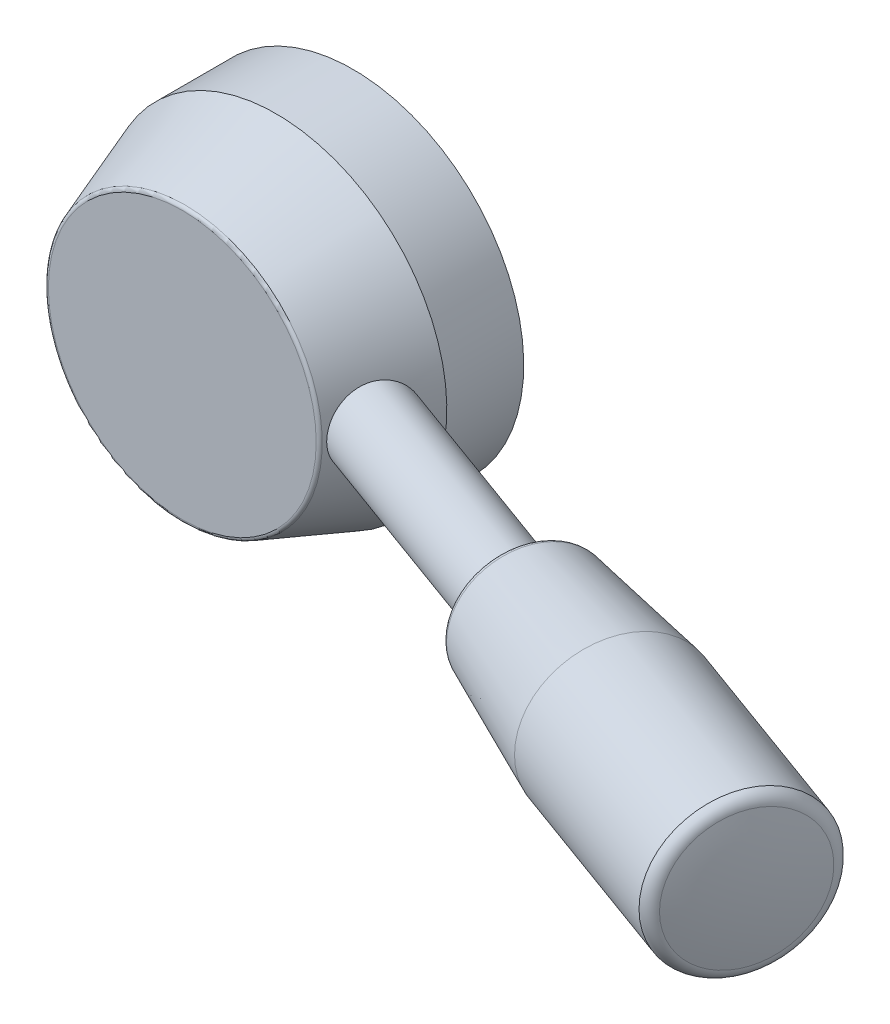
ISO-10303-21;
HEADER;
FILE_DESCRIPTION(('STEP AP214'),'2;1');
FILE_NAME('part.step','',(''),(''),'','','');
FILE_SCHEMA(('AUTOMOTIVE_DESIGN { 1 0 10303 214 1 1 1 1 }'));
ENDSEC;
DATA;
#1=APPLICATION_CONTEXT('core data for automotive mechanical design processes');
#2=APPLICATION_PROTOCOL_DEFINITION('international standard','automotive_design',2000,#1);
#3=PRODUCT_CONTEXT('',#1,'mechanical');
#4=PRODUCT('Part','Part','',(#3));
#5=PRODUCT_RELATED_PRODUCT_CATEGORY('part','',(#4));
#6=PRODUCT_DEFINITION_FORMATION('','',#4);
#7=PRODUCT_DEFINITION_CONTEXT('part definition',#1,'design');
#8=PRODUCT_DEFINITION('design','',#6,#7);
#9=PRODUCT_DEFINITION_SHAPE('','',#8);
#10=(LENGTH_UNIT() NAMED_UNIT(*) SI_UNIT(.MILLI.,.METRE.));
#11=(NAMED_UNIT(*) PLANE_ANGLE_UNIT() SI_UNIT($,.RADIAN.));
#12=(NAMED_UNIT(*) SI_UNIT($,.STERADIAN.) SOLID_ANGLE_UNIT());
#13=UNCERTAINTY_MEASURE_WITH_UNIT(LENGTH_MEASURE(1.E-05),#10,'distance_accuracy_value','');
#14=(GEOMETRIC_REPRESENTATION_CONTEXT(3) GLOBAL_UNCERTAINTY_ASSIGNED_CONTEXT((#13)) GLOBAL_UNIT_ASSIGNED_CONTEXT((#10,
#11,#12)) REPRESENTATION_CONTEXT('',''));
#15=CARTESIAN_POINT('',(0.,0.,0.));
#16=DIRECTION('',(0.,0.,1.));
#17=DIRECTION('',(1.,0.,0.));
#18=AXIS2_PLACEMENT_3D('',#15,#16,#17);
#19=CARTESIAN_POINT('',(0.,0.,21.8420201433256));
#20=DIRECTION('',(0.,0.,-1.));
#21=DIRECTION('',(0.,1.,0.));
#22=AXIS2_PLACEMENT_3D('',#19,#20,#21);
#23=CONICAL_SURFACE('',#22,18.2394850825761,0.349065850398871);
#24=CARTESIAN_POINT('',(0.,0.,22.171010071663));
#25=DIRECTION('',(0.,0.,1.));
#26=DIRECTION('',(0.,-1.,0.));
#27=AXIS2_PLACEMENT_3D('',#24,#25,#26);
#28=CIRCLE('',#27,18.1197425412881);
#29=CARTESIAN_POINT('',(0.,-18.1197425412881,22.171010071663));
#30=VERTEX_POINT('',#29);
#31=EDGE_CURVE('E8',#30,#30,#28,.F.);
#32=ORIENTED_EDGE('',*,*,#31,.T.);
#33=EDGE_LOOP('',(#32));
#34=FACE_BOUND('',#33,.T.);
#35=CARTESIAN_POINT('',(0.,0.,10.1363516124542));
#36=DIRECTION('',(0.,0.,1.));
#37=DIRECTION('',(0.,-1.,0.));
#38=AXIS2_PLACEMENT_3D('',#35,#36,#37);
#39=CIRCLE('',#38,22.5);
#40=CARTESIAN_POINT('',(0.,-22.5,10.1363516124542));
#41=VERTEX_POINT('',#40);
#42=EDGE_CURVE('E65',#41,#41,#39,.T.);
#43=ORIENTED_EDGE('',*,*,#42,.T.);
#44=EDGE_LOOP('',(#43));
#45=FACE_BOUND('',#44,.T.);
#46=CARTESIAN_POINT('',(21.03522681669,3.31735900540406,13.4465062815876));
#47=CARTESIAN_POINT('',(20.9413908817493,3.52790948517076,13.6110525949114));
#48=CARTESIAN_POINT('',(20.8404686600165,3.72265857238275,13.7919616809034));
#49=CARTESIAN_POINT('',(20.6295642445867,4.07519953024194,14.1824608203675));
#50=CARTESIAN_POINT('',(20.5195758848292,4.23296596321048,14.3920704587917));
#51=CARTESIAN_POINT('',(20.2959229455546,4.50704192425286,14.8352671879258));
#52=CARTESIAN_POINT('',(20.182256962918,4.62333542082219,15.0688635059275));
#53=CARTESIAN_POINT('',(19.9567147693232,4.81078269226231,15.5542752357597));
#54=CARTESIAN_POINT('',(19.8448380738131,4.88194889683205,15.8060856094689));
#55=CARTESIAN_POINT('',(19.6293852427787,4.97613745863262,16.3176963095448));
#56=CARTESIAN_POINT('',(19.5257145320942,4.99982251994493,16.5773345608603));
#57=CARTESIAN_POINT('',(19.3289618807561,5.00017543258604,17.1006124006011));
#58=CARTESIAN_POINT('',(19.2358787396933,4.97684861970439,17.3642515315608));
#59=CARTESIAN_POINT('',(19.0648236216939,4.88489105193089,17.8823700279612));
#60=CARTESIAN_POINT('',(18.9865830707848,4.81719029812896,18.1369266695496));
#61=CARTESIAN_POINT('',(18.8441366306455,4.63954525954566,18.6349711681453));
#62=CARTESIAN_POINT('',(18.7799316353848,4.52959828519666,18.8784583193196));
#63=CARTESIAN_POINT('',(18.6649406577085,4.26951338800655,19.3494883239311));
#64=CARTESIAN_POINT('',(18.6142863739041,4.11900768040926,19.5768599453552));
#65=CARTESIAN_POINT('',(18.5260220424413,3.78245485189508,20.0064591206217));
#66=CARTESIAN_POINT('',(18.488414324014,3.59640139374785,20.2086821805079));
#67=CARTESIAN_POINT('',(18.4235557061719,3.1882360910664,20.5868019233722));
#68=CARTESIAN_POINT('',(18.3966033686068,2.96530425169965,20.7618658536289));
#69=CARTESIAN_POINT('',(18.3522107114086,2.49293168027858,21.0731669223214));
#70=CARTESIAN_POINT('',(18.334770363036,2.24349102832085,21.2094041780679));
#71=CARTESIAN_POINT('',(18.3072451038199,1.72482906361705,21.4380050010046));
#72=CARTESIAN_POINT('',(18.2971602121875,1.45560769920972,21.530368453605));
#73=CARTESIAN_POINT('',(18.2826971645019,0.90515534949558,21.6674050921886));
#74=CARTESIAN_POINT('',(18.2783177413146,0.62392704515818,21.712088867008));
#75=CARTESIAN_POINT('',(18.2744636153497,0.0659502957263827,21.7512741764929));
#76=CARTESIAN_POINT('',(18.2748541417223,-0.210700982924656,21.7471547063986));
#77=CARTESIAN_POINT('',(18.2802929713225,-0.759266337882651,21.6922408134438));
#78=CARTESIAN_POINT('',(18.2853410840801,-1.03118060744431,21.6414482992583));
#79=CARTESIAN_POINT('',(18.3009309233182,-1.55999081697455,21.495994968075));
#80=CARTESIAN_POINT('',(18.3114195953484,-1.8170056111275,21.4017587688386));
#81=CARTESIAN_POINT('',(18.3394015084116,-2.31207637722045,21.1731007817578));
#82=CARTESIAN_POINT('',(18.3568958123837,-2.55012946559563,21.0386728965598));
#83=CARTESIAN_POINT('',(18.4013800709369,-3.00691505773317,20.7304200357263));
#84=CARTESIAN_POINT('',(18.4285946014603,-3.22502256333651,20.5557012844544));
#85=CARTESIAN_POINT('',(18.4946163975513,-3.62948438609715,20.1745410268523));
#86=CARTESIAN_POINT('',(18.5334251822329,-3.81583453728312,19.9680953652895));
#87=CARTESIAN_POINT('',(18.625401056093,-4.15501876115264,19.5256402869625));
#88=CARTESIAN_POINT('',(18.6788269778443,-4.30714864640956,19.2891436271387));
#89=CARTESIAN_POINT('',(18.8008876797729,-4.56871240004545,18.7972165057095));
#90=CARTESIAN_POINT('',(18.8695203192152,-4.67815227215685,18.5417887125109));
#91=CARTESIAN_POINT('',(19.0206381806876,-4.84934477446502,18.0244256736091));
#92=CARTESIAN_POINT('',(19.1028709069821,-4.91186875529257,17.7626722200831));
#93=CARTESIAN_POINT('',(19.2804098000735,-4.99014072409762,17.236633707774));
#94=CARTESIAN_POINT('',(19.3757141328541,-5.00589526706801,16.9723490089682));
#95=CARTESIAN_POINT('',(19.5740823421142,-4.99034218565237,16.455055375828));
#96=CARTESIAN_POINT('',(19.6769200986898,-4.96009808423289,16.2019267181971));
#97=CARTESIAN_POINT('',(19.8882921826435,-4.85554098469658,15.7074363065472));
#98=CARTESIAN_POINT('',(19.9968268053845,-4.78122569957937,15.4660751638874));
#99=CARTESIAN_POINT('',(20.21584121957,-4.59009301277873,14.999230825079));
#100=CARTESIAN_POINT('',(20.3263295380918,-4.47295507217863,14.7738831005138));
#101=CARTESIAN_POINT('',(20.543461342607,-4.19961575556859,14.3461941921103));
#102=CARTESIAN_POINT('',(20.6501042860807,-4.04340889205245,14.1438562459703));
#103=CARTESIAN_POINT('',(20.8570348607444,-3.69189082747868,13.7619847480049));
#104=CARTESIAN_POINT('',(20.9571078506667,-3.4957292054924,13.5831169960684));
#105=CARTESIAN_POINT('',(21.1429464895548,-3.07203776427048,13.2580549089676));
#106=CARTESIAN_POINT('',(21.2287114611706,-2.84450646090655,13.1118621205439));
#107=CARTESIAN_POINT('',(21.3818518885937,-2.36278265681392,12.8548052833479));
#108=CARTESIAN_POINT('',(21.4491183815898,-2.10844389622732,12.7441499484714));
#109=CARTESIAN_POINT('',(21.5608237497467,-1.5813611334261,12.5621368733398));
#110=CARTESIAN_POINT('',(21.6052658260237,-1.30861971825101,12.4907736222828));
#111=CARTESIAN_POINT('',(21.6681695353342,-0.757693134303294,12.3901626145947));
#112=CARTESIAN_POINT('',(21.6870826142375,-0.479693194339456,12.3601828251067));
#113=CARTESIAN_POINT('',(21.6993055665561,0.0782998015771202,12.3407811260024));
#114=CARTESIAN_POINT('',(21.6926150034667,0.358292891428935,12.3513599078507));
#115=CARTESIAN_POINT('',(21.6543103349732,0.907970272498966,12.4123247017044));
#116=CARTESIAN_POINT('',(21.6230615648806,1.17774539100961,12.4621272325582));
#117=CARTESIAN_POINT('',(21.5378371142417,1.70361627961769,12.599512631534));
#118=CARTESIAN_POINT('',(21.4838734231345,1.95971918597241,12.6870755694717));
#119=CARTESIAN_POINT('',(21.3677664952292,2.40675255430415,12.8786203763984));
#120=CARTESIAN_POINT('',(21.3088822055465,2.60107853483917,12.9767434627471));
#121=CARTESIAN_POINT('',(21.1798998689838,2.97271669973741,13.1953007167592));
#122=CARTESIAN_POINT('',(21.1098011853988,3.15002791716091,13.3157361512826));
#123=CARTESIAN_POINT('',(21.03522681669,3.31735900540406,13.4465062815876));
#124=B_SPLINE_CURVE_WITH_KNOTS('',3,(#46,#47,#48,#49,#50,#51,#52,#53,#54,#55,#56,#57,#58,#59,
#60,#61,#62,#63,#64,#65,#66,#67,#68,#69,#70,#71,#72,#73,#74,#75,#76,#77,#78,#79,#80,#81,#82,#83,
#84,#85,#86,#87,#88,#89,#90,#91,#92,#93,#94,#95,#96,#97,#98,#99,#100,#101,#102,#103,#104,#105,
#106,#107,#108,#109,#110,#111,#112,#113,#114,#115,#116,#117,#118,#119,#120,#121,#122,#123),
.UNSPECIFIED.,.T.,.F.,(4,2,2,2,2,2,2,2,2,2,2,2,2,2,2,2,2,2,2,2,2,2,2,2,2,2,2,2,2,2,2,2,2,2,2,2,
2,2,4),(0.,0.848850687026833,1.69828353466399,2.54804437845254,3.39757106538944,
4.23515580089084,5.07264547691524,5.89312110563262,6.71364897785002,7.54188345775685,
8.3702657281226,9.22044550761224,10.0706227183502,10.9208021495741,11.7707927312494,
12.5968244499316,13.4228223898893,14.2409128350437,15.0591274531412,15.8976189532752,
16.7362203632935,17.5907574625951,18.4451743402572,19.2852157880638,20.1251394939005,
20.9459365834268,21.7667762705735,22.5938903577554,23.4211206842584,24.268254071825,
25.115427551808,25.9674892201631,26.8194313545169,27.6561015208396,28.4927859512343,
29.3172539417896,30.1412873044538,30.8158573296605,31.4904656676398),.UNSPECIFIED.);
#125=CARTESIAN_POINT('',(21.03522681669,3.31735900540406,13.4465062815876));
#126=VERTEX_POINT('',#125);
#127=EDGE_CURVE('E23',#126,#126,#124,.T.);
#128=ORIENTED_EDGE('',*,*,#127,.F.);
#129=EDGE_LOOP('',(#128));
#130=FACE_BOUND('',#129,.T.);
#131=ADVANCED_FACE('F12',(#34,#45,#130),#23,.T.);
#132=CARTESIAN_POINT('',(-5.,0.,14.));
#133=DIRECTION('',(0.,0.,-1.));
#134=DIRECTION('',(0.,1.,0.));
#135=AXIS2_PLACEMENT_3D('',#132,#133,#134);
#136=PLANE('',#135);
#137=CARTESIAN_POINT('',(0.,0.,14.));
#138=DIRECTION('',(0.,0.,1.));
#139=DIRECTION('',(0.,-1.,0.));
#140=AXIS2_PLACEMENT_3D('',#137,#138,#139);
#141=CIRCLE('',#140,5.);
#142=CARTESIAN_POINT('',(0.,-5.,14.));
#143=VERTEX_POINT('',#142);
#144=EDGE_CURVE('E27',#143,#143,#141,.T.);
#145=ORIENTED_EDGE('',*,*,#144,.F.);
#146=EDGE_LOOP('',(#145));
#147=FACE_BOUND('',#146,.T.);
#148=ADVANCED_FACE('F14',(#147),#136,.T.);
#149=CARTESIAN_POINT('',(0.,0.,27.5));
#150=DIRECTION('',(0.,0.,1.));
#151=DIRECTION('',(0.,-1.,0.));
#152=AXIS2_PLACEMENT_3D('',#149,#150,#151);
#153=CYLINDRICAL_SURFACE('',#152,5.);
#154=CARTESIAN_POINT('',(0.,0.,0.));
#155=DIRECTION('',(0.,0.,1.));
#156=DIRECTION('',(0.,-1.,0.));
#157=AXIS2_PLACEMENT_3D('',#154,#155,#156);
#158=CIRCLE('',#157,5.);
#159=CARTESIAN_POINT('',(0.,-5.,0.));
#160=VERTEX_POINT('',#159);
#161=EDGE_CURVE('E73',#160,#160,#158,.T.);
#162=ORIENTED_EDGE('',*,*,#161,.F.);
#163=EDGE_LOOP('',(#162));
#164=FACE_BOUND('',#163,.T.);
#165=ORIENTED_EDGE('',*,*,#144,.T.);
#166=EDGE_LOOP('',(#165));
#167=FACE_BOUND('',#166,.T.);
#168=ADVANCED_FACE('F59',(#164,#167),#153,.F.);
#169=CARTESIAN_POINT('',(-22.5,0.,0.));
#170=DIRECTION('',(0.,0.,-1.));
#171=DIRECTION('',(0.,1.,0.));
#172=AXIS2_PLACEMENT_3D('',#169,#170,#171);
#173=PLANE('',#172);
#174=ORIENTED_EDGE('',*,*,#161,.T.);
#175=EDGE_LOOP('',(#174));
#176=FACE_BOUND('',#175,.T.);
#177=CARTESIAN_POINT('',(0.,0.,0.));
#178=DIRECTION('',(0.,0.,1.));
#179=DIRECTION('',(0.,-1.,0.));
#180=AXIS2_PLACEMENT_3D('',#177,#178,#179);
#181=CIRCLE('',#180,22.5);
#182=CARTESIAN_POINT('',(0.,-22.5,0.));
#183=VERTEX_POINT('',#182);
#184=EDGE_CURVE('E69',#183,#183,#181,.T.);
#185=ORIENTED_EDGE('',*,*,#184,.F.);
#186=EDGE_LOOP('',(#185));
#187=FACE_BOUND('',#186,.T.);
#188=ADVANCED_FACE('F53',(#176,#187),#173,.T.);
#189=CARTESIAN_POINT('',(0.,0.,27.5));
#190=DIRECTION('',(0.,0.,1.));
#191=DIRECTION('',(0.,-1.,0.));
#192=AXIS2_PLACEMENT_3D('',#189,#190,#191);
#193=CYLINDRICAL_SURFACE('',#192,22.5);
#194=ORIENTED_EDGE('',*,*,#184,.T.);
#195=EDGE_LOOP('',(#194));
#196=FACE_BOUND('',#195,.T.);
#197=ORIENTED_EDGE('',*,*,#42,.F.);
#198=EDGE_LOOP('',(#197));
#199=FACE_BOUND('',#198,.T.);
#200=ADVANCED_FACE('F48',(#196,#199),#193,.T.);
#201=CARTESIAN_POINT('',(-17.2997924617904,0.,22.5));
#202=DIRECTION('',(0.,0.,-1.));
#203=DIRECTION('',(0.,1.,0.));
#204=AXIS2_PLACEMENT_3D('',#201,#202,#203);
#205=PLANE('',#204);
#206=CARTESIAN_POINT('',(0.,0.,22.5));
#207=DIRECTION('',(0.,0.,-1.));
#208=DIRECTION('',(0.,1.,0.));
#209=AXIS2_PLACEMENT_3D('',#206,#207,#208);
#210=CIRCLE('',#209,17.6498962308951);
#211=CARTESIAN_POINT('',(0.,17.6498962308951,22.5));
#212=VERTEX_POINT('',#211);
#213=EDGE_CURVE('E19',#212,#212,#210,.F.);
#214=ORIENTED_EDGE('',*,*,#213,.T.);
#215=EDGE_LOOP('',(#214));
#216=FACE_BOUND('',#215,.T.);
#217=ADVANCED_FACE('F44',(#216),#205,.F.);
#218=CARTESIAN_POINT('',(102.678241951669,0.,47.1432295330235));
#219=DIRECTION('',(0.939692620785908,0.,0.342020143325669));
#220=DIRECTION('',(-0.342020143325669,0.,0.939692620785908));
#221=AXIS2_PLACEMENT_3D('',#218,#219,#220);
#222=CYLINDRICAL_SURFACE('',#221,5.);
#223=CARTESIAN_POINT('',(50.9508565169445,0.,28.3160009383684));
#224=DIRECTION('',(0.939692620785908,0.,0.342020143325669));
#225=DIRECTION('',(-0.342020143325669,0.,0.939692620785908));
#226=AXIS2_PLACEMENT_3D('',#223,#224,#225);
#227=CIRCLE('',#226,5.);
#228=CARTESIAN_POINT('',(49.2407558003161,0.,33.0144640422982));
#229=VERTEX_POINT('',#228);
#230=EDGE_CURVE('E70',#229,#229,#227,.T.);
#231=ORIENTED_EDGE('',*,*,#230,.F.);
#232=EDGE_LOOP('',(#231));
#233=FACE_BOUND('',#232,.T.);
#234=ORIENTED_EDGE('',*,*,#127,.T.);
#235=EDGE_LOOP('',(#234));
#236=FACE_BOUND('',#235,.T.);
#237=ADVANCED_FACE('F39',(#233,#236),#222,.T.);
#238=CARTESIAN_POINT('',(51.193677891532,0.,28.4043806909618));
#239=DIRECTION('',(0.939692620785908,0.,0.342020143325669));
#240=DIRECTION('',(-0.342020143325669,0.,0.939692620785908));
#241=AXIS2_PLACEMENT_3D('',#238,#239,#240);
#242=CONICAL_SURFACE('',#241,7.59501243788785,1.47154590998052);
#243=CARTESIAN_POINT('',(51.193677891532,0.,28.4043806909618));
#244=DIRECTION('',(0.939692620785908,0.,0.342020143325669));
#245=DIRECTION('',(-0.342020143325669,0.,0.939692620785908));
#246=AXIS2_PLACEMENT_3D('',#243,#244,#245);
#247=CIRCLE('',#246,7.59501243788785);
#248=CARTESIAN_POINT('',(48.5960306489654,0.,35.5413578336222));
#249=VERTEX_POINT('',#248);
#250=EDGE_CURVE('E76',#249,#249,#247,.T.);
#251=CARTESIAN_POINT('',(49.2407558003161,0.,33.0144640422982));
#252=CARTESIAN_POINT('',(49.2340399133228,0.,33.0407858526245));
#253=CARTESIAN_POINT('',(49.2273240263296,0.,33.0671076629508));
#254=CARTESIAN_POINT('',(49.2138922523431,0.,33.1197512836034));
#255=CARTESIAN_POINT('',(49.2071763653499,0.,33.1460730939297));
#256=CARTESIAN_POINT('',(49.1937445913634,0.,33.1987167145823));
#257=CARTESIAN_POINT('',(49.1870287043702,0.,33.2250385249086));
#258=CARTESIAN_POINT('',(49.1735969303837,0.,33.2776821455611));
#259=CARTESIAN_POINT('',(49.1668810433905,0.,33.3040039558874));
#260=CARTESIAN_POINT('',(49.153449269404,0.,33.35664757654));
#261=CARTESIAN_POINT('',(49.1467333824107,0.,33.3829693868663));
#262=CARTESIAN_POINT('',(49.1333016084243,0.,33.4356130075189));
#263=CARTESIAN_POINT('',(49.126585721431,0.,33.4619348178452));
#264=CARTESIAN_POINT('',(49.1131539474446,0.,33.5145784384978));
#265=CARTESIAN_POINT('',(49.1064380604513,0.,33.5409002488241));
#266=CARTESIAN_POINT('',(49.0930062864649,0.,33.5935438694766));
#267=CARTESIAN_POINT('',(49.0862903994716,0.,33.6198656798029));
#268=CARTESIAN_POINT('',(49.0728586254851,0.,33.6725093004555));
#269=CARTESIAN_POINT('',(49.0661427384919,0.,33.6988311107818));
#270=CARTESIAN_POINT('',(49.0527109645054,0.,33.7514747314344));
#271=CARTESIAN_POINT('',(49.0459950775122,0.,33.7777965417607));
#272=CARTESIAN_POINT('',(49.0325633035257,0.,33.8304401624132));
#273=CARTESIAN_POINT('',(49.0258474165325,0.,33.8567619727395));
#274=CARTESIAN_POINT('',(49.012415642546,0.,33.9094055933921));
#275=CARTESIAN_POINT('',(49.0056997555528,0.,33.9357274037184));
#276=CARTESIAN_POINT('',(48.9922679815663,0.,33.988371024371));
#277=CARTESIAN_POINT('',(48.9855520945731,0.,34.0146928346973));
#278=CARTESIAN_POINT('',(48.9721203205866,0.,34.0673364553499));
#279=CARTESIAN_POINT('',(48.9654044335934,0.,34.0936582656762));
#280=CARTESIAN_POINT('',(48.9519726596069,0.,34.1463018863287));
#281=CARTESIAN_POINT('',(48.9452567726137,0.,34.172623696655));
#282=CARTESIAN_POINT('',(48.9318249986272,0.,34.2252673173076));
#283=CARTESIAN_POINT('',(48.9251091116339,0.,34.2515891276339));
#284=CARTESIAN_POINT('',(48.9116773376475,0.,34.3042327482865));
#285=CARTESIAN_POINT('',(48.9049614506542,0.,34.3305545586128));
#286=CARTESIAN_POINT('',(48.8915296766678,0.,34.3831981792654));
#287=CARTESIAN_POINT('',(48.8848137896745,0.,34.4095199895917));
#288=CARTESIAN_POINT('',(48.8713820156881,0.,34.4621636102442));
#289=CARTESIAN_POINT('',(48.8646661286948,0.,34.4884854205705));
#290=CARTESIAN_POINT('',(48.8512343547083,0.,34.5411290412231));
#291=CARTESIAN_POINT('',(48.8445184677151,0.,34.5674508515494));
#292=CARTESIAN_POINT('',(48.8310866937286,0.,34.620094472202));
#293=CARTESIAN_POINT('',(48.8243708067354,0.,34.6464162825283));
#294=CARTESIAN_POINT('',(48.8109390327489,0.,34.6990599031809));
#295=CARTESIAN_POINT('',(48.8042231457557,0.,34.7253817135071));
#296=CARTESIAN_POINT('',(48.7907913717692,0.,34.7780253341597));
#297=CARTESIAN_POINT('',(48.784075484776,0.,34.804347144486));
#298=CARTESIAN_POINT('',(48.7706437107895,0.,34.8569907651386));
#299=CARTESIAN_POINT('',(48.7639278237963,0.,34.8833125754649));
#300=CARTESIAN_POINT('',(48.7504960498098,0.,34.9359561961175));
#301=CARTESIAN_POINT('',(48.7437801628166,0.,34.9622780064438));
#302=CARTESIAN_POINT('',(48.7303483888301,0.,35.0149216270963));
#303=CARTESIAN_POINT('',(48.7236325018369,0.,35.0412434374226));
#304=CARTESIAN_POINT('',(48.7102007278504,0.,35.0938870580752));
#305=CARTESIAN_POINT('',(48.7034848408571,0.,35.1202088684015));
#306=CARTESIAN_POINT('',(48.6900530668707,0.,35.1728524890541));
#307=CARTESIAN_POINT('',(48.6833371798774,0.,35.1991742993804));
#308=CARTESIAN_POINT('',(48.669905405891,0.,35.251817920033));
#309=CARTESIAN_POINT('',(48.6631895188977,0.,35.2781397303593));
#310=CARTESIAN_POINT('',(48.6497577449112,0.,35.3307833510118));
#311=CARTESIAN_POINT('',(48.643041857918,0.,35.3571051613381));
#312=CARTESIAN_POINT('',(48.6296100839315,0.,35.4097487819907));
#313=CARTESIAN_POINT('',(48.6228941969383,0.,35.436070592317));
#314=CARTESIAN_POINT('',(48.6094624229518,0.,35.4887142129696));
#315=CARTESIAN_POINT('',(48.6027465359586,0.,35.5150360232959));
#316=CARTESIAN_POINT('',(48.5960306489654,0.,35.5413578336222));
#317=B_SPLINE_CURVE_WITH_KNOTS('',3,(#251,#252,#253,#254,#255,#256,#257,#258,#259,#260,#261,
#262,#263,#264,#265,#266,#267,#268,#269,#270,#271,#272,#273,#274,#275,#276,#277,#278,#279,#280,
#281,#282,#283,#284,#285,#286,#287,#288,#289,#290,#291,#292,#293,#294,#295,#296,#297,#298,#299,
#300,#301,#302,#303,#304,#305,#306,#307,#308,#309,#310,#311,#312,#313,#314,#315,#316),
.UNSPECIFIED.,.F.,.F.,(4,2,2,2,2,2,2,2,2,2,2,2,2,2,2,2,2,2,2,2,2,2,2,2,2,2,2,2,2,2,2,2,4),(0.,
0.0814951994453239,0.162990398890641,0.244485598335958,0.325980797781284,0.407475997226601,
0.488971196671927,0.570466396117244,0.651961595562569,0.733456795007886,0.814951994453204,
0.896447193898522,0.97794239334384,1.05943759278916,1.14093279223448,1.22242799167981,
1.30392319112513,1.38541839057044,1.46691359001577,1.54840878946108,1.62990398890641,
1.71139918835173,1.79289438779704,1.87438958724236,1.95588478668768,2.037379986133,
2.11887518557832,2.20037038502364,2.28186558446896,2.36336078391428,2.44485598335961,
2.52635118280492,2.60784638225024),.UNSPECIFIED.);
#318=EDGE_CURVE('BSEAM43',#229,#249,#317,.T.);
#319=ORIENTED_EDGE('',*,*,#230,.T.);
#320=ORIENTED_EDGE('',*,*,#250,.F.);
#321=ORIENTED_EDGE('',*,*,#318,.T.);
#322=ORIENTED_EDGE('',*,*,#318,.F.);
#323=EDGE_LOOP('',(#319,#321,#320,#322));
#324=FACE_BOUND('',#323,.T.);
#325=ADVANCED_FACE('F43',(#324),#242,.T.);
#326=CARTESIAN_POINT('',(52.133370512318,0.,28.7464008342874));
#327=DIRECTION('',(0.939692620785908,0.,0.342020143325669));
#328=DIRECTION('',(-0.342020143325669,0.,0.939692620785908));
#329=AXIS2_PLACEMENT_3D('',#326,#327,#328);
#330=TOROIDAL_SURFACE('',#329,7.59501243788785,1.);
#331=ORIENTED_EDGE('',*,*,#250,.T.);
#332=EDGE_LOOP('',(#331));
#333=FACE_BOUND('',#332,.T.);
#334=CARTESIAN_POINT('',(52.0398676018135,0.,28.7123685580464));
#335=DIRECTION('',(0.939692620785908,0.,0.342020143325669));
#336=DIRECTION('',(-0.342020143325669,0.,0.939692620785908));
#337=AXIS2_PLACEMENT_3D('',#334,#335,#336);
#338=CIRCLE('',#337,8.59004962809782);
#339=CARTESIAN_POINT('',(49.1018975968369,0.,36.7843748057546));
#340=VERTEX_POINT('',#339);
#341=EDGE_CURVE('E202',#340,#340,#338,.T.);
#342=ORIENTED_EDGE('',*,*,#341,.F.);
#343=EDGE_LOOP('',(#342));
#344=FACE_BOUND('',#343,.T.);
#345=ADVANCED_FACE('F126',(#333,#344),#330,.T.);
#346=CARTESIAN_POINT('',(69.9875303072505,0.,35.244783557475));
#347=DIRECTION('',(0.939692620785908,0.,0.342020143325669));
#348=DIRECTION('',(-0.342020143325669,0.,0.939692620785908));
#349=AXIS2_PLACEMENT_3D('',#346,#347,#348);
#350=CONICAL_SURFACE('',#349,10.5,0.0996686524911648);
#351=CARTESIAN_POINT('',(69.9875303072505,0.,35.244783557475));
#352=DIRECTION('',(0.939692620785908,0.,0.342020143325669));
#353=DIRECTION('',(-0.342020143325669,0.,0.939692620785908));
#354=AXIS2_PLACEMENT_3D('',#351,#352,#353);
#355=CIRCLE('',#354,10.5);
#356=CARTESIAN_POINT('',(66.396318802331,0.,45.111556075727));
#357=VERTEX_POINT('',#356);
#358=EDGE_CURVE('E197',#357,#357,#355,.T.);
#359=CARTESIAN_POINT('',(49.1018975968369,0.,36.7843748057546));
#360=CARTESIAN_POINT('',(49.2820478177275,0.,36.8711162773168));
#361=CARTESIAN_POINT('',(49.462198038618,0.,36.957857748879));
#362=CARTESIAN_POINT('',(49.8224984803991,0.,37.1313406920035));
#363=CARTESIAN_POINT('',(50.0026487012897,0.,37.2180821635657));
#364=CARTESIAN_POINT('',(50.3629491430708,0.,37.3915651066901));
#365=CARTESIAN_POINT('',(50.5430993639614,0.,37.4783065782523));
#366=CARTESIAN_POINT('',(50.9033998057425,0.,37.6517895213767));
#367=CARTESIAN_POINT('',(51.0835500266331,0.,37.7385309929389));
#368=CARTESIAN_POINT('',(51.4438504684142,0.,37.9120139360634));
#369=CARTESIAN_POINT('',(51.6240006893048,0.,37.9987554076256));
#370=CARTESIAN_POINT('',(51.9843011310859,0.,38.17223835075));
#371=CARTESIAN_POINT('',(52.1644513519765,0.,38.2589798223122));
#372=CARTESIAN_POINT('',(52.5247517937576,0.,38.4324627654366));
#373=CARTESIAN_POINT('',(52.7049020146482,0.,38.5192042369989));
#374=CARTESIAN_POINT('',(53.0652024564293,0.,38.6926871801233));
#375=CARTESIAN_POINT('',(53.2453526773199,0.,38.7794286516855));
#376=CARTESIAN_POINT('',(53.605653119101,0.,38.9529115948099));
#377=CARTESIAN_POINT('',(53.7858033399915,0.,39.0396530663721));
#378=CARTESIAN_POINT('',(54.1461037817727,0.,39.2131360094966));
#379=CARTESIAN_POINT('',(54.3262540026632,0.,39.2998774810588));
#380=CARTESIAN_POINT('',(54.6865544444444,0.,39.4733604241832));
#381=CARTESIAN_POINT('',(54.8667046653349,0.,39.5601018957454));
#382=CARTESIAN_POINT('',(55.2270051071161,0.,39.7335848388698));
#383=CARTESIAN_POINT('',(55.4071553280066,0.,39.8203263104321));
#384=CARTESIAN_POINT('',(55.7674557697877,0.,39.9938092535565));
#385=CARTESIAN_POINT('',(55.9476059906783,0.,40.0805507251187));
#386=CARTESIAN_POINT('',(56.3079064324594,0.,40.2540336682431));
#387=CARTESIAN_POINT('',(56.48805665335,0.,40.3407751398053));
#388=CARTESIAN_POINT('',(56.8483570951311,0.,40.5142580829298));
#389=CARTESIAN_POINT('',(57.0285073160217,0.,40.600999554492));
#390=CARTESIAN_POINT('',(57.3888077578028,0.,40.7744824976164));
#391=CARTESIAN_POINT('',(57.5689579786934,0.,40.8612239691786));
#392=CARTESIAN_POINT('',(57.9292584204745,0.,41.034706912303));
#393=CARTESIAN_POINT('',(58.1094086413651,0.,41.1214483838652));
#394=CARTESIAN_POINT('',(58.4697090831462,0.,41.2949313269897));
#395=CARTESIAN_POINT('',(58.6498593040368,0.,41.3816727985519));
#396=CARTESIAN_POINT('',(59.0101597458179,0.,41.5551557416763));
#397=CARTESIAN_POINT('',(59.1903099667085,0.,41.6418972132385));
#398=CARTESIAN_POINT('',(59.5506104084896,0.,41.8153801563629));
#399=CARTESIAN_POINT('',(59.7307606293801,0.,41.9021216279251));
#400=CARTESIAN_POINT('',(60.0910610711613,0.,42.0756045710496));
#401=CARTESIAN_POINT('',(60.2712112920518,0.,42.1623460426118));
#402=CARTESIAN_POINT('',(60.631511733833,0.,42.3358289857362));
#403=CARTESIAN_POINT('',(60.8116619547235,0.,42.4225704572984));
#404=CARTESIAN_POINT('',(61.1719623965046,0.,42.5960534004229));
#405=CARTESIAN_POINT('',(61.3521126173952,0.,42.6827948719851));
#406=CARTESIAN_POINT('',(61.7124130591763,0.,42.8562778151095));
#407=CARTESIAN_POINT('',(61.8925632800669,0.,42.9430192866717));
#408=CARTESIAN_POINT('',(62.252863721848,0.,43.1165022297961));
#409=CARTESIAN_POINT('',(62.4330139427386,0.,43.2032437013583));
#410=CARTESIAN_POINT('',(62.7933143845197,0.,43.3767266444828));
#411=CARTESIAN_POINT('',(62.9734646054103,0.,43.463468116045));
#412=CARTESIAN_POINT('',(63.3337650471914,0.,43.6369510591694));
#413=CARTESIAN_POINT('',(63.513915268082,0.,43.7236925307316));
#414=CARTESIAN_POINT('',(63.8742157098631,0.,43.897175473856));
#415=CARTESIAN_POINT('',(64.0543659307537,0.,43.9839169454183));
#416=CARTESIAN_POINT('',(64.4146663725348,0.,44.1573998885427));
#417=CARTESIAN_POINT('',(64.5948165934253,0.,44.2441413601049));
#418=CARTESIAN_POINT('',(64.9551170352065,0.,44.4176243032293));
#419=CARTESIAN_POINT('',(65.135267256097,0.,44.5043657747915));
#420=CARTESIAN_POINT('',(65.4955676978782,0.,44.677848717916));
#421=CARTESIAN_POINT('',(65.6757179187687,0.,44.7645901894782));
#422=CARTESIAN_POINT('',(66.0360183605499,0.,44.9380731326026));
#423=CARTESIAN_POINT('',(66.2161685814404,0.,45.0248146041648));
#424=CARTESIAN_POINT('',(66.396318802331,0.,45.111556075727));
#425=B_SPLINE_CURVE_WITH_KNOTS('',3,(#359,#360,#361,#362,#363,#364,#365,#366,#367,#368,#369,
#370,#371,#372,#373,#374,#375,#376,#377,#378,#379,#380,#381,#382,#383,#384,#385,#386,#387,#388,
#389,#390,#391,#392,#393,#394,#395,#396,#397,#398,#399,#400,#401,#402,#403,#404,#405,#406,#407,
#408,#409,#410,#411,#412,#413,#414,#415,#416,#417,#418,#419,#420,#421,#422,#423,#424),
.UNSPECIFIED.,.F.,.F.,(4,2,2,2,2,2,2,2,2,2,2,2,2,2,2,2,2,2,2,2,2,2,2,2,2,2,2,2,2,2,2,2,4),(0.,
0.599836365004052,1.19967273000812,1.79950909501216,2.39934546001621,2.99918182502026,
3.59901819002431,4.19885455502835,4.7986909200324,5.39852728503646,5.99836365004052,
6.59820001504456,7.19803638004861,7.79787274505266,8.39770911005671,8.99754547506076,
9.5973818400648,10.1972182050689,10.7970545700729,11.396890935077,11.996727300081,
12.5965636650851,13.1964000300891,13.7962363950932,14.3960727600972,14.9959091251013,
15.5957454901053,16.1955818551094,16.7954182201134,17.3952545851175,17.9950909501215,
18.5949273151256,19.1947636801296),.UNSPECIFIED.);
#426=EDGE_CURVE('BSEAM135',#340,#357,#425,.T.);
#427=ORIENTED_EDGE('',*,*,#341,.T.);
#428=ORIENTED_EDGE('',*,*,#358,.F.);
#429=ORIENTED_EDGE('',*,*,#426,.T.);
#430=ORIENTED_EDGE('',*,*,#426,.F.);
#431=EDGE_LOOP('',(#427,#429,#428,#430));
#432=FACE_BOUND('',#431,.T.);
#433=ADVANCED_FACE('F135',(#432),#350,.T.);
#434=CARTESIAN_POINT('',(102.678241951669,0.,47.1432295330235));
#435=DIRECTION('',(0.939692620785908,0.,0.342020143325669));
#436=DIRECTION('',(-0.342020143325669,0.,0.939692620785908));
#437=AXIS2_PLACEMENT_3D('',#434,#435,#436);
#438=CYLINDRICAL_SURFACE('',#437,10.5);
#439=CARTESIAN_POINT('',(95.782067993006,0.,44.633227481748));
#440=DIRECTION('',(0.939692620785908,0.,0.342020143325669));
#441=DIRECTION('',(-0.342020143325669,0.,0.939692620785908));
#442=AXIS2_PLACEMENT_3D('',#439,#440,#441);
#443=CIRCLE('',#442,10.5);
#444=CARTESIAN_POINT('',(92.1908564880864,0.,54.5000000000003));
#445=VERTEX_POINT('',#444);
#446=EDGE_CURVE('E194',#445,#445,#443,.T.);
#447=CARTESIAN_POINT('',(92.1908564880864,0.,54.5000000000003));
#448=CARTESIAN_POINT('',(91.9221633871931,0.,54.4022037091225));
#449=CARTESIAN_POINT('',(91.6534702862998,0.,54.3044074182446));
#450=CARTESIAN_POINT('',(91.1160840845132,0.,54.1088148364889));
#451=CARTESIAN_POINT('',(90.8473909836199,0.,54.0110185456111));
#452=CARTESIAN_POINT('',(90.3100047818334,0.,53.8154259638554));
#453=CARTESIAN_POINT('',(90.0413116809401,0.,53.7176296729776));
#454=CARTESIAN_POINT('',(89.5039254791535,0.,53.5220370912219));
#455=CARTESIAN_POINT('',(89.2352323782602,0.,53.424240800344));
#456=CARTESIAN_POINT('',(88.6978461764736,0.,53.2286482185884));
#457=CARTESIAN_POINT('',(88.4291530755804,0.,53.1308519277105));
#458=CARTESIAN_POINT('',(87.8917668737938,0.,52.9352593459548));
#459=CARTESIAN_POINT('',(87.6230737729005,0.,52.837463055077));
#460=CARTESIAN_POINT('',(87.0856875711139,0.,52.6418704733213));
#461=CARTESIAN_POINT('',(86.8169944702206,0.,52.5440741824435));
#462=CARTESIAN_POINT('',(86.2796082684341,0.,52.3484816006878));
#463=CARTESIAN_POINT('',(86.0109151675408,0.,52.2506853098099));
#464=CARTESIAN_POINT('',(85.4735289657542,0.,52.0550927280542));
#465=CARTESIAN_POINT('',(85.2048358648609,0.,51.9572964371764));
#466=CARTESIAN_POINT('',(84.6674496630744,0.,51.7617038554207));
#467=CARTESIAN_POINT('',(84.3987565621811,0.,51.6639075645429));
#468=CARTESIAN_POINT('',(83.8613703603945,0.,51.4683149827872));
#469=CARTESIAN_POINT('',(83.5926772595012,0.,51.3705186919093));
#470=CARTESIAN_POINT('',(83.0552910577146,0.,51.1749261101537));
#471=CARTESIAN_POINT('',(82.7865979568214,0.,51.0771298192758));
#472=CARTESIAN_POINT('',(82.2492117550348,0.,50.8815372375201));
#473=CARTESIAN_POINT('',(81.9805186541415,0.,50.7837409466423));
#474=CARTESIAN_POINT('',(81.4431324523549,0.,50.5881483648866));
#475=CARTESIAN_POINT('',(81.1744393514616,0.,50.4903520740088));
#476=CARTESIAN_POINT('',(80.6370531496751,0.,50.2947594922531));
#477=CARTESIAN_POINT('',(80.3683600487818,0.,50.1969632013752));
#478=CARTESIAN_POINT('',(79.8309738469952,0.,50.0013706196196));
#479=CARTESIAN_POINT('',(79.5622807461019,0.,49.9035743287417));
#480=CARTESIAN_POINT('',(79.0248945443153,0.,49.707981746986));
#481=CARTESIAN_POINT('',(78.756201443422,0.,49.6101854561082));
#482=CARTESIAN_POINT('',(78.2188152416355,0.,49.4145928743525));
#483=CARTESIAN_POINT('',(77.9501221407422,0.,49.3167965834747));
#484=CARTESIAN_POINT('',(77.4127359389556,0.,49.121204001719));
#485=CARTESIAN_POINT('',(77.1440428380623,0.,49.0234077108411));
#486=CARTESIAN_POINT('',(76.6066566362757,0.,48.8278151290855));
#487=CARTESIAN_POINT('',(76.3379635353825,0.,48.7300188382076));
#488=CARTESIAN_POINT('',(75.8005773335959,0.,48.5344262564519));
#489=CARTESIAN_POINT('',(75.5318842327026,0.,48.4366299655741));
#490=CARTESIAN_POINT('',(74.994498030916,0.,48.2410373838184));
#491=CARTESIAN_POINT('',(74.7258049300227,0.,48.1432410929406));
#492=CARTESIAN_POINT('',(74.1884187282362,0.,47.9476485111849));
#493=CARTESIAN_POINT('',(73.9197256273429,0.,47.849852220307));
#494=CARTESIAN_POINT('',(73.3823394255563,0.,47.6542596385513));
#495=CARTESIAN_POINT('',(73.113646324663,0.,47.5564633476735));
#496=CARTESIAN_POINT('',(72.5762601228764,0.,47.3608707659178));
#497=CARTESIAN_POINT('',(72.3075670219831,0.,47.26307447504));
#498=CARTESIAN_POINT('',(71.7701808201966,0.,47.0674818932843));
#499=CARTESIAN_POINT('',(71.5014877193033,0.,46.9696856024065));
#500=CARTESIAN_POINT('',(70.9641015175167,0.,46.7740930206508));
#501=CARTESIAN_POINT('',(70.6954084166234,0.,46.6762967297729));
#502=CARTESIAN_POINT('',(70.1580222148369,0.,46.4807041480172));
#503=CARTESIAN_POINT('',(69.8893291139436,0.,46.3829078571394));
#504=CARTESIAN_POINT('',(69.351942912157,0.,46.1873152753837));
#505=CARTESIAN_POINT('',(69.0832498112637,0.,46.0895189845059));
#506=CARTESIAN_POINT('',(68.5458636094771,0.,45.8939264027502));
#507=CARTESIAN_POINT('',(68.2771705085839,0.,45.7961301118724));
#508=CARTESIAN_POINT('',(67.7397843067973,0.,45.6005375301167));
#509=CARTESIAN_POINT('',(67.471091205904,0.,45.5027412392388));
#510=CARTESIAN_POINT('',(66.9337050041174,0.,45.3071486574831));
#511=CARTESIAN_POINT('',(66.6650119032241,0.,45.2093523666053));
#512=CARTESIAN_POINT('',(66.3963188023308,0.,45.1115560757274));
#513=B_SPLINE_CURVE_WITH_KNOTS('',3,(#447,#448,#449,#450,#451,#452,#453,#454,#455,#456,#457,
#458,#459,#460,#461,#462,#463,#464,#465,#466,#467,#468,#469,#470,#471,#472,#473,#474,#475,#476,
#477,#478,#479,#480,#481,#482,#483,#484,#485,#486,#487,#488,#489,#490,#491,#492,#493,#494,#495,
#496,#497,#498,#499,#500,#501,#502,#503,#504,#505,#506,#507,#508,#509,#510,#511,#512),
.UNSPECIFIED.,.F.,.F.,(4,2,2,2,2,2,2,2,2,2,2,2,2,2,2,2,2,2,2,2,2,2,2,2,2,2,2,2,2,2,2,2,4),(0.,
0.857811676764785,1.71562335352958,2.57343503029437,3.43124670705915,4.28905838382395,
5.14687006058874,6.00468173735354,6.86249341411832,7.72030509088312,8.5781167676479,
9.43592844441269,10.2937401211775,11.1515517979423,12.0093634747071,12.8671751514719,
13.7249868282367,14.5827985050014,15.4406101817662,16.298421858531,17.1562335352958,
18.0140452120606,18.8718568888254,19.7296685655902,20.587480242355,21.4452919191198,
22.3031035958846,23.1609152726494,24.0187269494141,24.8765386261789,25.7343503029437,
26.5921619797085,27.4499736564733),.UNSPECIFIED.);
#514=EDGE_CURVE('BSEAM144',#445,#357,#513,.T.);
#515=ORIENTED_EDGE('',*,*,#446,.F.);
#516=ORIENTED_EDGE('',*,*,#358,.T.);
#517=ORIENTED_EDGE('',*,*,#514,.T.);
#518=ORIENTED_EDGE('',*,*,#514,.F.);
#519=EDGE_LOOP('',(#515,#517,#516,#518));
#520=FACE_BOUND('',#519,.T.);
#521=ADVANCED_FACE('F144',(#520),#438,.T.);
#522=CARTESIAN_POINT('',(95.294571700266,0.,44.4557933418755));
#523=DIRECTION('',(0.939692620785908,0.,0.342020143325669));
#524=DIRECTION('',(-0.342020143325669,0.,0.939692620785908));
#525=AXIS2_PLACEMENT_3D('',#522,#523,#524);
#526=TOROIDAL_SURFACE('',#525,8.82866386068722,1.75);
#527=ORIENTED_EDGE('',*,*,#446,.T.);
#528=EDGE_LOOP('',(#527));
#529=FACE_BOUND('',#528,.T.);
#530=CARTESIAN_POINT('',(96.9341027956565,0.,45.0525338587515));
#531=DIRECTION('',(0.939692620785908,0.,0.342020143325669));
#532=DIRECTION('',(-0.342020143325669,0.,0.939692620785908));
#533=AXIS2_PLACEMENT_3D('',#530,#531,#532);
#534=CIRCLE('',#533,8.96408373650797);
#535=CARTESIAN_POINT('',(93.8682055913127,0.,53.476017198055));
#536=VERTEX_POINT('',#535);
#537=EDGE_CURVE('E192',#536,#536,#534,.T.);
#538=ORIENTED_EDGE('',*,*,#537,.F.);
#539=EDGE_LOOP('',(#538));
#540=FACE_BOUND('',#539,.T.);
#541=ADVANCED_FACE('F154',(#529,#540),#526,.T.);
#542=CARTESIAN_POINT('',(50.9951478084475,0.,28.332121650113));
#543=DIRECTION('',(0.,-1.,0.));
#544=DIRECTION('',(1.,0.,0.));
#545=AXIS2_PLACEMENT_3D('',#542,#543,#544);
#546=SPHERICAL_SURFACE('',#545,49.702259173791);
#547=CARTESIAN_POINT('',(50.9951478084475,0.,28.332121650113));
#548=DIRECTION('',(0.939692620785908,0.,0.342020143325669));
#549=DIRECTION('',(-0.342020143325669,0.,0.939692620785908));
#550=AXIS2_PLACEMENT_3D('',#547,#548,#549);
#551=SPHERICAL_SURFACE('',#550,49.702259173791);
#552=ORIENTED_EDGE('',*,*,#537,.T.);
#553=EDGE_LOOP('',(#552));
#554=FACE_BOUND('',#553,.T.);
#555=ADVANCED_FACE('F164',(#554),#551,.T.);
#556=CARTESIAN_POINT('',(0.,0.,22.));
#557=DIRECTION('',(0.,0.,-1.));
#558=DIRECTION('',(0.,1.,0.));
#559=AXIS2_PLACEMENT_3D('',#556,#557,#558);
#560=TOROIDAL_SURFACE('',#559,17.6498962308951,0.5);
#561=ORIENTED_EDGE('',*,*,#31,.F.);
#562=EDGE_LOOP('',(#561));
#563=FACE_BOUND('',#562,.T.);
#564=ORIENTED_EDGE('',*,*,#213,.F.);
#565=EDGE_LOOP('',(#564));
#566=FACE_BOUND('',#565,.T.);
#567=ADVANCED_FACE('F174',(#563,#566),#560,.T.);
#568=CLOSED_SHELL('',(#131,#148,#168,#188,#200,#217,#237,#325,#345,#433,#521,#541,#555,#567));
#569=MANIFOLD_SOLID_BREP('B1',#568);
#570=ADVANCED_BREP_SHAPE_REPRESENTATION('',(#18,#569),#14);
#571=SHAPE_DEFINITION_REPRESENTATION(#9,#570);
ENDSEC;
END-ISO-10303-21;
